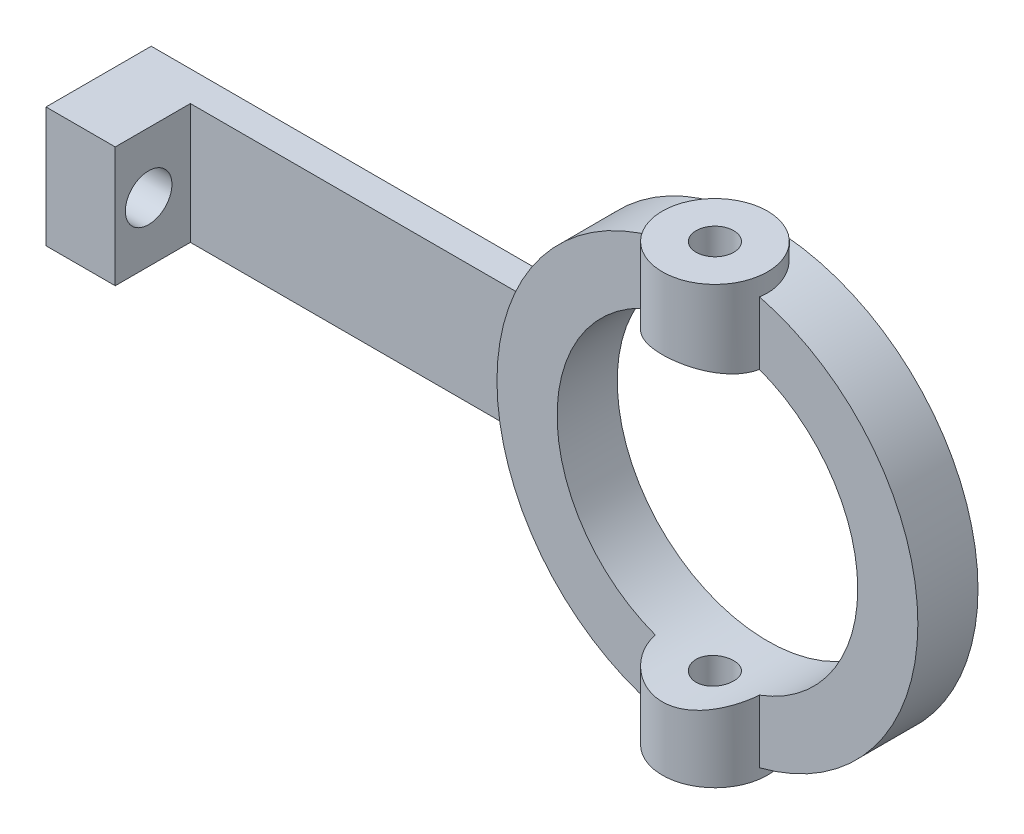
from build123d import *

# Parameters (mm, degrees)
ESQUISSE1_W                  = 30
ESQUISSE1_H                  = 8
BOSS_EXTRU_1_DEPTH           = 2
BOSS_EXTRU_2_DEPTH           = 10
BOSS_EXTRU_2_DEPTH_BACK      = 19
ESQUISSE2_R                  = 3.5
ESQUISSE3_R                  = 14
BOSS_EXTRU_3_DEPTH           = 4
ENL_V_MAT_EXTRU_1_DEPTH      = 365.800726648
ENL_V_MAT_EXTRU_1_DEPTH_BACK = 365.800726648
ESQUISSE4_R                  = 10
ENL_V_MAT_EXTRU_2_DEPTH      = 362.095554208
ENL_V_MAT_EXTRU_2_DEPTH_BACK = 362.095554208
ESQUISSE5_R                  = 1.25
ESQUISSE6_W                  = 4.605501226
ESQUISSE6_H                  = 8
BOSS_EXTRU_4_DEPTH           = 5
ESQUISSE7_R                  = 1.55
ENL_V_MAT_EXTRU_3_DEPTH      = 5


with BuildPart() as part:
    # Esquisse1 → Boss.-Extru.1 (new body)
    with BuildSketch(Plane.XY):
        with Locations((-344.861083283, 44.695652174)):
            Rectangle(ESQUISSE1_W, ESQUISSE1_H)
    extrude(amount=BOSS_EXTRU_1_DEPTH)



with BuildPart() as body_2:
    # Esquisse2 → Boss.-Extru.2 (new, two sides: drawn at the far end of the back side and taken through both)
    with BuildSketch(Plane.XZ.offset(-40.695652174).offset(-BOSS_EXTRU_2_DEPTH_BACK)):
        with Locations(Location((-318.861083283, 3.5, 0), (0, 0, 270))):
            Circle(ESQUISSE2_R)
    extrude(amount=BOSS_EXTRU_2_DEPTH + BOSS_EXTRU_2_DEPTH_BACK)


with BuildPart() as part_1:
    add(part.part)

    add(body_2.part)  # Boss.-Extru.3 merges body 2
    # Esquisse3 → Boss.-Extru.3 (add)
    with BuildSketch(Plane(origin=(0, 0, 0), x_dir=(-1, 0, 0), z_dir=(0, 0, -1))):
        with Locations((318.861083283, 44.922510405)):
            Circle(ESQUISSE3_R)
    extrude(amount=-BOSS_EXTRU_3_DEPTH)

    # Esquisse4 → Enl_v. mat.-Extru.1 (cut, two sides: drawn at the far end of the back side and taken through both)
    with BuildSketch(Plane.XY.offset(4).offset(-ENL_V_MAT_EXTRU_1_DEPTH_BACK)):
        with Locations((-318.861083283, 44.922510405)):
            Circle(ESQUISSE4_R)
    extrude(amount=ENL_V_MAT_EXTRU_1_DEPTH + ENL_V_MAT_EXTRU_1_DEPTH_BACK, mode=Mode.SUBTRACT)

    # Esquisse5 → Enl_v. mat.-Extru.2 (cut, two sides: drawn at the far end of the back side and taken through both)
    with BuildSketch(Plane.XZ.offset(-30.695652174).offset(-ENL_V_MAT_EXTRU_2_DEPTH_BACK)):
        with Locations(Location((-318.861083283, 3.5, 0), (0, 0, 270))):
            Circle(ESQUISSE5_R)
    extrude(amount=ENL_V_MAT_EXTRU_2_DEPTH + ENL_V_MAT_EXTRU_2_DEPTH_BACK, mode=Mode.SUBTRACT)

    # Esquisse6 → Boss.-Extru.4 (add)
    with BuildSketch(Plane.XY.offset(2)):
        with Locations((-357.55833267, 44.695652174)):
            Rectangle(ESQUISSE6_W, ESQUISSE6_H)
    extrude(amount=BOSS_EXTRU_4_DEPTH)

    # Esquisse7 → Enl_v. mat.-Extru.3 (cut)
    with BuildSketch(Plane.ZY.offset(359.861083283)):
        with Locations((4.778037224, 44.659579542)):
            Circle(ESQUISSE7_R)
    extrude(amount=-ENL_V_MAT_EXTRU_3_DEPTH, mode=Mode.SUBTRACT)


solid = part_1.part
